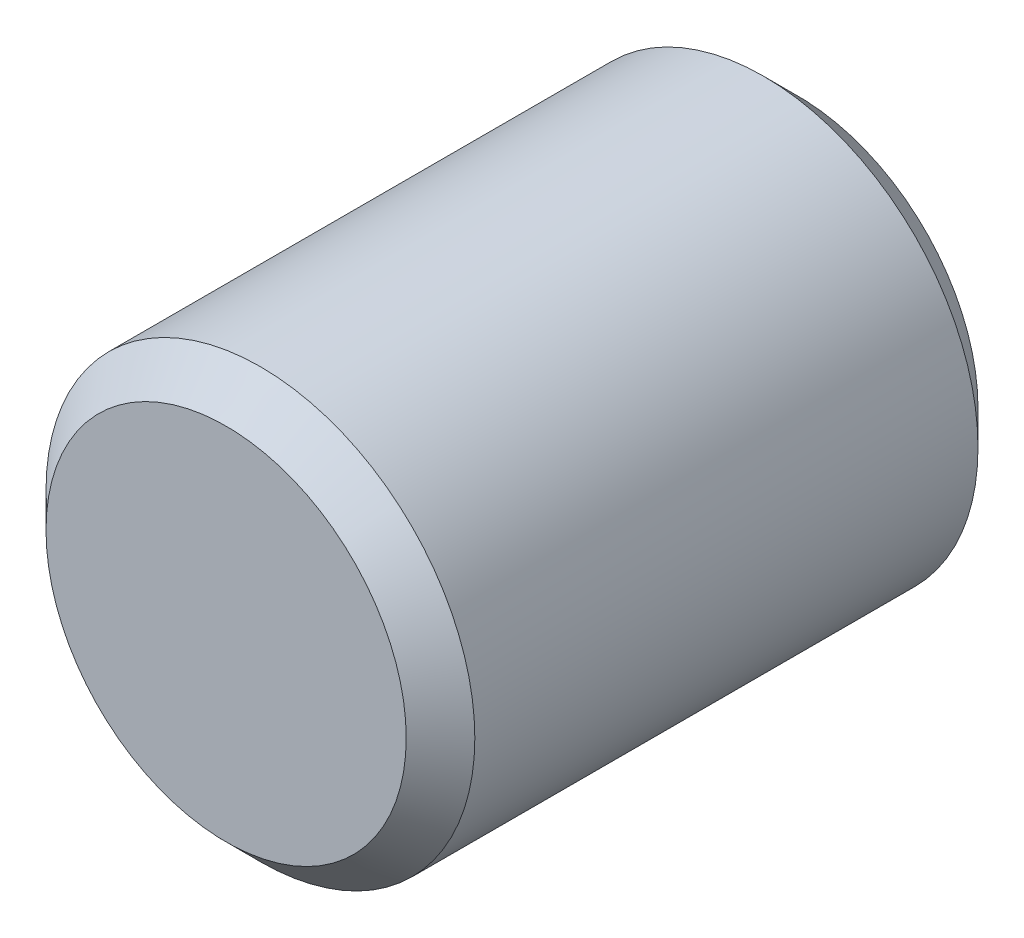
from build123d import *

# Parameters (mm, degrees)
SKETCH1_R      = 2.38125
EXTRUDE1_DEPTH = 3.175
CHAMFER1_SIZE  = 0.381


with BuildPart() as part:
    # Sketch1 → Extrude1 (new, symmetric)
    with BuildSketch(Plane.XY):
        Circle(SKETCH1_R)
    extrude(amount=EXTRUDE1_DEPTH, both=True)

    # Chamfer1
    chamfer1_edges = [part.edges().sort_by_distance(p)[0] for p in [
        (-2.38125, 0, -3.175),
        (-2.38125, 0, 3.175),
    ]]
    chamfer(chamfer1_edges, length=CHAMFER1_SIZE)


solid = part.part
